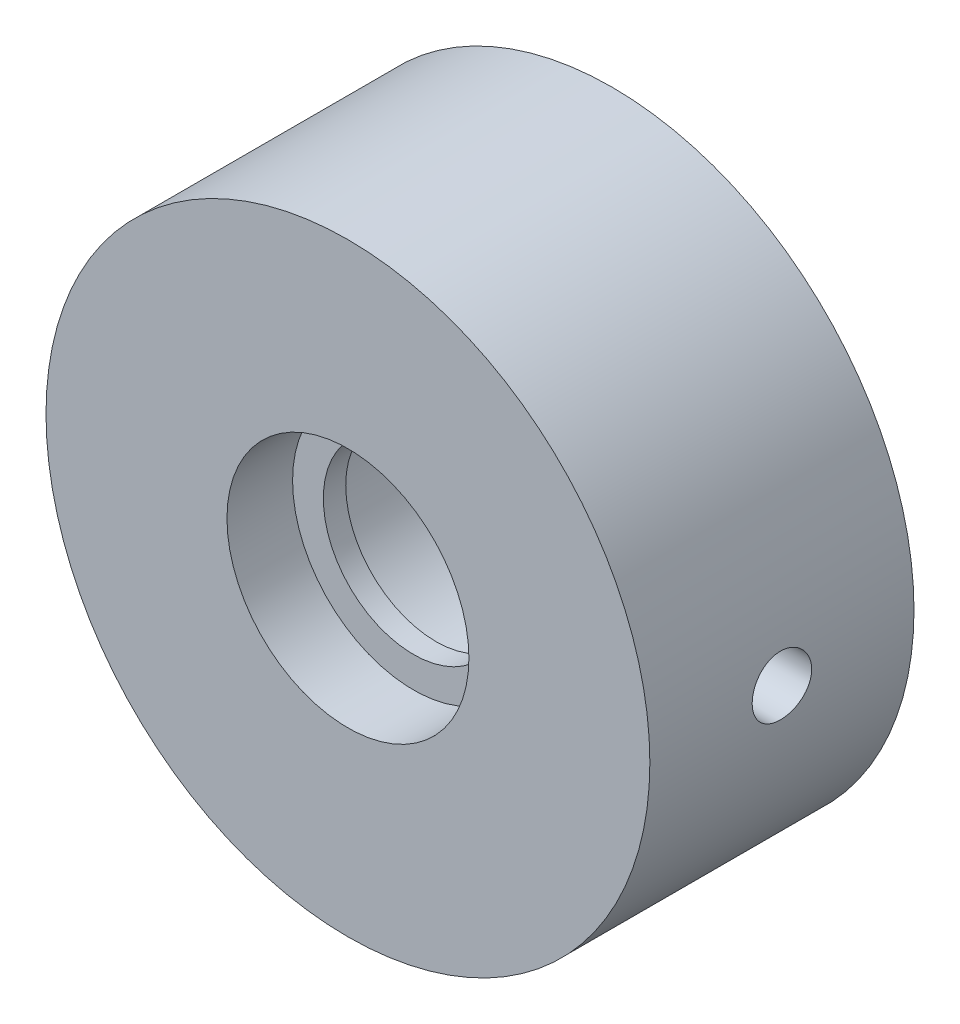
ISO-10303-21;
HEADER;
FILE_DESCRIPTION(('STEP AP214'),'2;1');
FILE_NAME('part.step','',(''),(''),'','','');
FILE_SCHEMA(('AUTOMOTIVE_DESIGN { 1 0 10303 214 1 1 1 1 }'));
ENDSEC;
DATA;
#1=APPLICATION_CONTEXT('core data for automotive mechanical design processes');
#2=APPLICATION_PROTOCOL_DEFINITION('international standard','automotive_design',2000,#1);
#3=PRODUCT_CONTEXT('',#1,'mechanical');
#4=PRODUCT('Part','Part','',(#3));
#5=PRODUCT_RELATED_PRODUCT_CATEGORY('part','',(#4));
#6=PRODUCT_DEFINITION_FORMATION('','',#4);
#7=PRODUCT_DEFINITION_CONTEXT('part definition',#1,'design');
#8=PRODUCT_DEFINITION('design','',#6,#7);
#9=PRODUCT_DEFINITION_SHAPE('','',#8);
#10=(LENGTH_UNIT() NAMED_UNIT(*) SI_UNIT(.MILLI.,.METRE.));
#11=(NAMED_UNIT(*) PLANE_ANGLE_UNIT() SI_UNIT($,.RADIAN.));
#12=(NAMED_UNIT(*) SI_UNIT($,.STERADIAN.) SOLID_ANGLE_UNIT());
#13=UNCERTAINTY_MEASURE_WITH_UNIT(LENGTH_MEASURE(1.E-05),#10,'distance_accuracy_value','');
#14=(GEOMETRIC_REPRESENTATION_CONTEXT(3) GLOBAL_UNCERTAINTY_ASSIGNED_CONTEXT((#13)) GLOBAL_UNIT_ASSIGNED_CONTEXT((#10,
#11,#12)) REPRESENTATION_CONTEXT('',''));
#15=CARTESIAN_POINT('',(0.,0.,0.));
#16=DIRECTION('',(0.,0.,1.));
#17=DIRECTION('',(1.,0.,0.));
#18=AXIS2_PLACEMENT_3D('',#15,#16,#17);
#19=CARTESIAN_POINT('',(0.,0.,12.7));
#20=DIRECTION('',(0.,0.,-1.));
#21=DIRECTION('',(-1.,0.,0.));
#22=AXIS2_PLACEMENT_3D('',#19,#20,#21);
#23=CYLINDRICAL_SURFACE('',#22,29.95);
#24=CARTESIAN_POINT('',(-29.95,0.,2.55));
#25=CARTESIAN_POINT('',(-29.9499981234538,-0.165273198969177,2.54999283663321));
#26=CARTESIAN_POINT('',(-29.9486174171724,-0.330655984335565,2.53606414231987));
#27=CARTESIAN_POINT('',(-29.9432422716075,-0.656837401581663,2.48070961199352));
#28=CARTESIAN_POINT('',(-29.9392449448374,-0.817630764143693,2.43925339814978));
#29=CARTESIAN_POINT('',(-29.9290878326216,-1.12986261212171,2.33006160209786));
#30=CARTESIAN_POINT('',(-29.922929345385,-1.28130664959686,2.26234179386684));
#31=CARTESIAN_POINT('',(-29.9091387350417,-1.57064517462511,2.10257551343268));
#32=CARTESIAN_POINT('',(-29.9015069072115,-1.70854236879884,2.01053391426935));
#33=CARTESIAN_POINT('',(-29.8855948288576,-1.96738830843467,1.80439121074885));
#34=CARTESIAN_POINT('',(-29.8773126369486,-2.08828305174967,1.69022244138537));
#35=CARTESIAN_POINT('',(-29.8610493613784,-2.30922826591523,1.44321043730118));
#36=CARTESIAN_POINT('',(-29.8530682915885,-2.40927777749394,1.310366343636));
#37=CARTESIAN_POINT('',(-29.8382909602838,-2.58588296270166,1.02943767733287));
#38=CARTESIAN_POINT('',(-29.831497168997,-2.66238989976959,0.881322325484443));
#39=CARTESIAN_POINT('',(-29.8198874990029,-2.78942697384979,0.574269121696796));
#40=CARTESIAN_POINT('',(-29.815071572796,-2.83995773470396,0.415331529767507));
#41=CARTESIAN_POINT('',(-29.807980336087,-2.91344829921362,0.0916953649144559));
#42=CARTESIAN_POINT('',(-29.8056967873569,-2.9364975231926,-0.0729827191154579));
#43=CARTESIAN_POINT('',(-29.803903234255,-2.95464712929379,-0.403884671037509));
#44=CARTESIAN_POINT('',(-29.8043931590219,-2.94974822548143,-0.570108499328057));
#45=CARTESIAN_POINT('',(-29.8080836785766,-2.91221436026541,-0.898767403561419));
#46=CARTESIAN_POINT('',(-29.8112747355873,-2.87967698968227,-1.06121374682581));
#47=CARTESIAN_POINT('',(-29.8199930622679,-2.78794163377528,-1.37832860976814));
#48=CARTESIAN_POINT('',(-29.8255203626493,-2.72874329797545,-1.53299702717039));
#49=CARTESIAN_POINT('',(-29.8382993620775,-2.58525856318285,-1.83047411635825));
#50=CARTESIAN_POINT('',(-29.845554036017,-2.50092881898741,-1.97326174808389));
#51=CARTESIAN_POINT('',(-29.8609678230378,-2.30960623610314,-2.24269382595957));
#52=CARTESIAN_POINT('',(-29.8691269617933,-2.20261275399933,-2.36933781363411));
#53=CARTESIAN_POINT('',(-29.8854728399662,-1.96845455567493,-2.60345477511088));
#54=CARTESIAN_POINT('',(-29.8936595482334,-1.84120554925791,-2.71084346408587));
#55=CARTESIAN_POINT('',(-29.9091051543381,-1.57044125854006,-2.90274834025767));
#56=CARTESIAN_POINT('',(-29.916364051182,-1.42692595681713,-2.98726450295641));
#57=CARTESIAN_POINT('',(-29.9291384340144,-1.12764490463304,-3.13102166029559));
#58=CARTESIAN_POINT('',(-29.934653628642,-0.971877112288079,-3.19025843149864));
#59=CARTESIAN_POINT('',(-29.9433161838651,-0.652540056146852,-3.28171378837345));
#60=CARTESIAN_POINT('',(-29.9464636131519,-0.488971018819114,-3.31393315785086));
#61=CARTESIAN_POINT('',(-29.9500271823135,-0.159404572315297,-3.35033231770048));
#62=CARTESIAN_POINT('',(-29.9504546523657,0.0065798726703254,-3.35462842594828));
#63=CARTESIAN_POINT('',(-29.9485605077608,0.336906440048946,-3.33536454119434));
#64=CARTESIAN_POINT('',(-29.9462389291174,0.501248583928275,-3.31180491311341));
#65=CARTESIAN_POINT('',(-29.9391148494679,0.823290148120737,-3.23759481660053));
#66=CARTESIAN_POINT('',(-29.934317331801,0.981002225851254,-3.18699875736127));
#67=CARTESIAN_POINT('',(-29.9227796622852,1.28570010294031,-3.06020791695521));
#68=CARTESIAN_POINT('',(-29.916039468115,1.43268566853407,-2.98401257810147));
#69=CARTESIAN_POINT('',(-29.9013423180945,1.71228438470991,-2.80789724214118));
#70=CARTESIAN_POINT('',(-29.8933814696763,1.84484915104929,-2.70790076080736));
#71=CARTESIAN_POINT('',(-29.877148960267,2.09135360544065,-2.48713141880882));
#72=CARTESIAN_POINT('',(-29.868877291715,2.20529284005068,-2.36635805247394));
#73=CARTESIAN_POINT('',(-29.8529213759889,2.41171530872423,-2.10695599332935));
#74=CARTESIAN_POINT('',(-29.8452392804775,2.50412224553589,-1.96826643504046));
#75=CARTESIAN_POINT('',(-29.8313647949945,2.66433265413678,-1.67726935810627));
#76=CARTESIAN_POINT('',(-29.8251723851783,2.73213645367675,-1.52496202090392));
#77=CARTESIAN_POINT('',(-29.8149916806,2.84108794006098,-1.21131531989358));
#78=CARTESIAN_POINT('',(-29.810999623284,2.88228115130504,-1.04999189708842));
#79=CARTESIAN_POINT('',(-29.8056598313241,2.93698989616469,-0.72267684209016));
#80=CARTESIAN_POINT('',(-29.804312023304,2.95050619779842,-0.556685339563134));
#81=CARTESIAN_POINT('',(-29.8044148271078,2.9494669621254,-0.225504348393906));
#82=CARTESIAN_POINT('',(-29.805853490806,2.93503128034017,-0.0603144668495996));
#83=CARTESIAN_POINT('',(-29.8113416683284,2.87874902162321,0.265281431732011));
#84=CARTESIAN_POINT('',(-29.8153911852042,2.83690241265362,0.425687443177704));
#85=CARTESIAN_POINT('',(-29.8256414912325,2.72701898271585,0.73716219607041));
#86=CARTESIAN_POINT('',(-29.8318420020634,2.65898554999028,0.888232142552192));
#87=CARTESIAN_POINT('',(-29.8456962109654,2.49867214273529,1.17682756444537));
#88=CARTESIAN_POINT('',(-29.8533498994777,2.40639232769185,1.31435312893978));
#89=CARTESIAN_POINT('',(-29.8692873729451,2.19975542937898,1.57257015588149));
#90=CARTESIAN_POINT('',(-29.8775736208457,2.08530907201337,1.69319002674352));
#91=CARTESIAN_POINT('',(-29.8938200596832,1.83776338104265,1.913566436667));
#92=CARTESIAN_POINT('',(-29.901780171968,1.70465958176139,2.01331796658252));
#93=CARTESIAN_POINT('',(-29.9164976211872,1.42322179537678,2.18931716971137));
#94=CARTESIAN_POINT('',(-29.9232519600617,1.27485125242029,2.26550659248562));
#95=CARTESIAN_POINT('',(-29.9347640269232,0.967451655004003,2.39178923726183));
#96=CARTESIAN_POINT('',(-29.939524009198,0.808434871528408,2.44191193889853));
#97=CARTESIAN_POINT('',(-29.9453124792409,0.540428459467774,2.50211409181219));
#98=CARTESIAN_POINT('',(-29.9470621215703,0.433153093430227,2.52004683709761));
#99=CARTESIAN_POINT('',(-29.949406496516,0.217267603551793,2.54399212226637));
#100=CARTESIAN_POINT('',(-29.9500012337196,0.108657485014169,2.55000470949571));
#101=CARTESIAN_POINT('',(-29.95,0.,2.55));
#102=B_SPLINE_CURVE_WITH_KNOTS('',3,(#24,#25,#26,#27,#28,#29,#30,#31,#32,#33,#34,#35,#36,#37,
#38,#39,#40,#41,#42,#43,#44,#45,#46,#47,#48,#49,#50,#51,#52,#53,#54,#55,#56,#57,#58,#59,#60,#61,
#62,#63,#64,#65,#66,#67,#68,#69,#70,#71,#72,#73,#74,#75,#76,#77,#78,#79,#80,#81,#82,#83,#84,#85,
#86,#87,#88,#89,#90,#91,#92,#93,#94,#95,#96,#97,#98,#99,#100,#101),.UNSPECIFIED.,.T.,.F.,(4,2,2,
2,2,2,2,2,2,2,2,2,2,2,2,2,2,2,2,2,2,2,2,2,2,2,2,2,2,2,2,2,2,2,2,2,2,2,4),(0.,0.495422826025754,
0.991393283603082,1.48706632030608,1.98264012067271,2.4797540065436,2.97689076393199,
3.47504984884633,3.97319696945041,4.4697187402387,4.9662278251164,5.46099100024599,
5.95576067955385,6.45138869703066,6.94703078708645,7.44479209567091,7.94255393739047,
8.44039890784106,8.93822943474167,9.43398484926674,9.929733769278,10.4244887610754,
10.9192545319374,11.4156322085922,11.9120219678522,12.4101447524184,12.9082609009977,
13.4055226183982,13.9027705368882,14.3978910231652,14.8930120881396,15.3880691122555,
15.8831228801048,16.380213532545,16.877423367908,17.375852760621,17.8737172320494,
18.199430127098,18.5251417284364),.UNSPECIFIED.);
#103=CARTESIAN_POINT('',(-29.95,0.,2.55));
#104=VERTEX_POINT('',#103);
#105=EDGE_CURVE('E43',#104,#104,#102,.T.);
#106=ORIENTED_EDGE('',*,*,#105,.T.);
#107=EDGE_LOOP('',(#106));
#108=FACE_BOUND('',#107,.T.);
#109=CARTESIAN_POINT('',(0.,0.,12.7));
#110=DIRECTION('',(0.,0.,1.));
#111=DIRECTION('',(1.,0.,0.));
#112=AXIS2_PLACEMENT_3D('',#109,#110,#111);
#113=CIRCLE('',#112,29.95);
#114=CARTESIAN_POINT('',(29.95,0.,12.7));
#115=VERTEX_POINT('',#114);
#116=EDGE_CURVE('E51',#115,#115,#113,.T.);
#117=ORIENTED_EDGE('',*,*,#116,.F.);
#118=EDGE_LOOP('',(#117));
#119=FACE_BOUND('',#118,.T.);
#120=CARTESIAN_POINT('',(0.,0.,-13.5));
#121=DIRECTION('',(0.,0.,-1.));
#122=DIRECTION('',(-1.,0.,0.));
#123=AXIS2_PLACEMENT_3D('',#120,#121,#122);
#124=CIRCLE('',#123,29.95);
#125=CARTESIAN_POINT('',(-29.95,0.,-13.5));
#126=VERTEX_POINT('',#125);
#127=EDGE_CURVE('E104',#126,#126,#124,.T.);
#128=ORIENTED_EDGE('',*,*,#127,.F.);
#129=EDGE_LOOP('',(#128));
#130=FACE_BOUND('',#129,.T.);
#131=CARTESIAN_POINT('',(29.95,0.,-3.35));
#132=CARTESIAN_POINT('',(29.9499981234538,0.165273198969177,-3.3499928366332));
#133=CARTESIAN_POINT('',(29.9486174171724,0.330655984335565,-3.33606414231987));
#134=CARTESIAN_POINT('',(29.9432422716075,0.656837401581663,-3.28070961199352));
#135=CARTESIAN_POINT('',(29.9392449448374,0.817630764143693,-3.23925339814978));
#136=CARTESIAN_POINT('',(29.9290878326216,1.12986261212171,-3.13006160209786));
#137=CARTESIAN_POINT('',(29.922929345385,1.28130664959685,-3.06234179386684));
#138=CARTESIAN_POINT('',(29.9091387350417,1.57064517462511,-2.90257551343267));
#139=CARTESIAN_POINT('',(29.9015069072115,1.70854236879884,-2.81053391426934));
#140=CARTESIAN_POINT('',(29.8855948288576,1.96738830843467,-2.60439121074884));
#141=CARTESIAN_POINT('',(29.8773126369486,2.08828305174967,-2.49022244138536));
#142=CARTESIAN_POINT('',(29.8610493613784,2.30922826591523,-2.24321043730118));
#143=CARTESIAN_POINT('',(29.8530682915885,2.40927777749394,-2.110366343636));
#144=CARTESIAN_POINT('',(29.8382909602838,2.58588296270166,-1.82943767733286));
#145=CARTESIAN_POINT('',(29.831497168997,2.66238989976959,-1.68132232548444));
#146=CARTESIAN_POINT('',(29.8198874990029,2.78942697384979,-1.37426912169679));
#147=CARTESIAN_POINT('',(29.815071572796,2.83995773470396,-1.2153315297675));
#148=CARTESIAN_POINT('',(29.807980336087,2.91344829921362,-0.89169536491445));
#149=CARTESIAN_POINT('',(29.8056967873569,2.9364975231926,-0.727017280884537));
#150=CARTESIAN_POINT('',(29.803903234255,2.95464712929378,-0.396115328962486));
#151=CARTESIAN_POINT('',(29.8043931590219,2.94974822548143,-0.229891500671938));
#152=CARTESIAN_POINT('',(29.8080836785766,2.91221436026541,0.098767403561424));
#153=CARTESIAN_POINT('',(29.8112747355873,2.87967698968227,0.261213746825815));
#154=CARTESIAN_POINT('',(29.8199930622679,2.78794163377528,0.578328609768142));
#155=CARTESIAN_POINT('',(29.8255203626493,2.72874329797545,0.732997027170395));
#156=CARTESIAN_POINT('',(29.8382993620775,2.58525856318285,1.03047411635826));
#157=CARTESIAN_POINT('',(29.845554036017,2.5009288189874,1.1732617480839));
#158=CARTESIAN_POINT('',(29.8609678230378,2.30960623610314,1.44269382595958));
#159=CARTESIAN_POINT('',(29.8691269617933,2.20261275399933,1.56933781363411));
#160=CARTESIAN_POINT('',(29.8854728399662,1.96845455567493,1.80345477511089));
#161=CARTESIAN_POINT('',(29.8936595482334,1.84120554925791,1.91084346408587));
#162=CARTESIAN_POINT('',(29.9091051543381,1.57044125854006,2.10274834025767));
#163=CARTESIAN_POINT('',(29.916364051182,1.42692595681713,2.18726450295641));
#164=CARTESIAN_POINT('',(29.9291384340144,1.12764490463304,2.3310216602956));
#165=CARTESIAN_POINT('',(29.934653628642,0.971877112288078,2.39025843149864));
#166=CARTESIAN_POINT('',(29.9433161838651,0.652540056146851,2.48171378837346));
#167=CARTESIAN_POINT('',(29.9464636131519,0.488971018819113,2.51393315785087));
#168=CARTESIAN_POINT('',(29.9500271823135,0.159404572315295,2.55033231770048));
#169=CARTESIAN_POINT('',(29.9504546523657,-0.00657987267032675,2.55462842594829));
#170=CARTESIAN_POINT('',(29.9485605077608,-0.336906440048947,2.53536454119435));
#171=CARTESIAN_POINT('',(29.9462389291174,-0.501248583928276,2.51180491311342));
#172=CARTESIAN_POINT('',(29.9391148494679,-0.823290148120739,2.43759481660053));
#173=CARTESIAN_POINT('',(29.934317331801,-0.981002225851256,2.38699875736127));
#174=CARTESIAN_POINT('',(29.9227796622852,-1.28570010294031,2.26020791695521));
#175=CARTESIAN_POINT('',(29.916039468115,-1.43268566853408,2.18401257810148));
#176=CARTESIAN_POINT('',(29.9013423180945,-1.71228438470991,2.00789724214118));
#177=CARTESIAN_POINT('',(29.8933814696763,-1.84484915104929,1.90790076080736));
#178=CARTESIAN_POINT('',(29.877148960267,-2.09135360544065,1.68713141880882));
#179=CARTESIAN_POINT('',(29.868877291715,-2.20529284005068,1.56635805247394));
#180=CARTESIAN_POINT('',(29.8529213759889,-2.41171530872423,1.30695599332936));
#181=CARTESIAN_POINT('',(29.8452392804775,-2.50412224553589,1.16826643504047));
#182=CARTESIAN_POINT('',(29.8313647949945,-2.66433265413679,0.877269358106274));
#183=CARTESIAN_POINT('',(29.8251723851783,-2.73213645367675,0.724962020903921));
#184=CARTESIAN_POINT('',(29.8149916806,-2.84108794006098,0.411315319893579));
#185=CARTESIAN_POINT('',(29.810999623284,-2.88228115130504,0.249991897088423));
#186=CARTESIAN_POINT('',(29.8056598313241,-2.93698989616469,-0.0773231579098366));
#187=CARTESIAN_POINT('',(29.804312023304,-2.95050619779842,-0.243314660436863));
#188=CARTESIAN_POINT('',(29.8044148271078,-2.9494669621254,-0.57449565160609));
#189=CARTESIAN_POINT('',(29.805853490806,-2.93503128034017,-0.739685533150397));
#190=CARTESIAN_POINT('',(29.8113416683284,-2.87874902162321,-1.06528143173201));
#191=CARTESIAN_POINT('',(29.8153911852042,-2.83690241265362,-1.2256874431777));
#192=CARTESIAN_POINT('',(29.8256414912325,-2.72701898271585,-1.53716219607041));
#193=CARTESIAN_POINT('',(29.8318420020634,-2.65898554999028,-1.68823214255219));
#194=CARTESIAN_POINT('',(29.8456962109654,-2.49867214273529,-1.97682756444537));
#195=CARTESIAN_POINT('',(29.8533498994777,-2.40639232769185,-2.11435312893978));
#196=CARTESIAN_POINT('',(29.8692873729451,-2.19975542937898,-2.37257015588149));
#197=CARTESIAN_POINT('',(29.8775736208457,-2.08530907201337,-2.49319002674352));
#198=CARTESIAN_POINT('',(29.8938200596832,-1.83776338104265,-2.713566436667));
#199=CARTESIAN_POINT('',(29.901780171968,-1.70465958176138,-2.81331796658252));
#200=CARTESIAN_POINT('',(29.9164976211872,-1.42322179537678,-2.98931716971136));
#201=CARTESIAN_POINT('',(29.9232519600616,-1.27485125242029,-3.06550659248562));
#202=CARTESIAN_POINT('',(29.9347640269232,-0.967451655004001,-3.19178923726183));
#203=CARTESIAN_POINT('',(29.939524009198,-0.808434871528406,-3.24191193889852));
#204=CARTESIAN_POINT('',(29.9453124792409,-0.540428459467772,-3.30211409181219));
#205=CARTESIAN_POINT('',(29.9470621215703,-0.433153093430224,-3.32004683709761));
#206=CARTESIAN_POINT('',(29.949406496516,-0.217267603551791,-3.34399212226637));
#207=CARTESIAN_POINT('',(29.9500012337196,-0.108657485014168,-3.3500047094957));
#208=CARTESIAN_POINT('',(29.95,0.,-3.35));
#209=B_SPLINE_CURVE_WITH_KNOTS('',3,(#131,#132,#133,#134,#135,#136,#137,#138,#139,#140,#141,
#142,#143,#144,#145,#146,#147,#148,#149,#150,#151,#152,#153,#154,#155,#156,#157,#158,#159,#160,
#161,#162,#163,#164,#165,#166,#167,#168,#169,#170,#171,#172,#173,#174,#175,#176,#177,#178,#179,
#180,#181,#182,#183,#184,#185,#186,#187,#188,#189,#190,#191,#192,#193,#194,#195,#196,#197,#198,
#199,#200,#201,#202,#203,#204,#205,#206,#207,#208),.UNSPECIFIED.,.T.,.F.,(4,2,2,2,2,2,2,2,2,2,2,
2,2,2,2,2,2,2,2,2,2,2,2,2,2,2,2,2,2,2,2,2,2,2,2,2,2,2,4),(0.,0.495422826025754,
0.991393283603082,1.48706632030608,1.98264012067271,2.4797540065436,2.97689076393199,
3.47504984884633,3.97319696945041,4.4697187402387,4.9662278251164,5.46099100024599,
5.95576067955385,6.45138869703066,6.94703078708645,7.4447920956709,7.94255393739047,
8.44039890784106,8.93822943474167,9.43398484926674,9.929733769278,10.4244887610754,
10.9192545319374,11.4156322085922,11.9120219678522,12.4101447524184,12.9082609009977,
13.4055226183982,13.9027705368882,14.3978910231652,14.8930120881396,15.3880691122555,
15.8831228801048,16.380213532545,16.877423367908,17.375852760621,17.8737172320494,
18.199430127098,18.5251417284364),.UNSPECIFIED.);
#210=CARTESIAN_POINT('',(29.95,0.,-3.35));
#211=VERTEX_POINT('',#210);
#212=EDGE_CURVE('E10',#211,#211,#209,.T.);
#213=ORIENTED_EDGE('',*,*,#212,.F.);
#214=EDGE_LOOP('',(#213));
#215=FACE_BOUND('',#214,.T.);
#216=ADVANCED_FACE('F33',(#108,#119,#130,#215),#23,.T.);
#217=CARTESIAN_POINT('',(0.,0.,12.7));
#218=DIRECTION('',(0.,0.,-1.));
#219=DIRECTION('',(-1.,0.,0.));
#220=AXIS2_PLACEMENT_3D('',#217,#218,#219);
#221=CYLINDRICAL_SURFACE('',#220,12.);
#222=CARTESIAN_POINT('',(0.,0.,12.7));
#223=DIRECTION('',(0.,0.,-1.));
#224=DIRECTION('',(-1.,0.,0.));
#225=AXIS2_PLACEMENT_3D('',#222,#223,#224);
#226=CIRCLE('',#225,12.);
#227=CARTESIAN_POINT('',(-12.,0.,12.7));
#228=VERTEX_POINT('',#227);
#229=EDGE_CURVE('E118',#228,#228,#226,.T.);
#230=ORIENTED_EDGE('',*,*,#229,.F.);
#231=EDGE_LOOP('',(#230));
#232=FACE_BOUND('',#231,.T.);
#233=CARTESIAN_POINT('',(0.,0.,6.19125));
#234=DIRECTION('',(0.,0.,-1.));
#235=DIRECTION('',(-1.,0.,0.));
#236=AXIS2_PLACEMENT_3D('',#233,#234,#235);
#237=CIRCLE('',#236,12.);
#238=CARTESIAN_POINT('',(-12.,0.,6.19125));
#239=VERTEX_POINT('',#238);
#240=EDGE_CURVE('E47',#239,#239,#237,.F.);
#241=ORIENTED_EDGE('',*,*,#240,.F.);
#242=EDGE_LOOP('',(#241));
#243=FACE_BOUND('',#242,.T.);
#244=ADVANCED_FACE('F85',(#232,#243),#221,.F.);
#245=CARTESIAN_POINT('',(0.,0.,12.7));
#246=DIRECTION('',(0.,0.,1.));
#247=DIRECTION('',(1.,0.,0.));
#248=AXIS2_PLACEMENT_3D('',#245,#246,#247);
#249=PLANE('',#248);
#250=ORIENTED_EDGE('',*,*,#229,.T.);
#251=EDGE_LOOP('',(#250));
#252=FACE_BOUND('',#251,.T.);
#253=ORIENTED_EDGE('',*,*,#116,.T.);
#254=EDGE_LOOP('',(#253));
#255=FACE_BOUND('',#254,.T.);
#256=ADVANCED_FACE('F83',(#252,#255),#249,.T.);
#257=CARTESIAN_POINT('',(0.,0.,3.96875));
#258=DIRECTION('',(0.,0.,-1.));
#259=DIRECTION('',(-1.,0.,0.));
#260=AXIS2_PLACEMENT_3D('',#257,#258,#259);
#261=CIRCLE('',#260,12.);
#262=CARTESIAN_POINT('',(-12.,0.,3.96875));
#263=VERTEX_POINT('',#262);
#264=EDGE_CURVE('E115',#263,#263,#261,.T.);
#265=ORIENTED_EDGE('',*,*,#264,.F.);
#266=EDGE_LOOP('',(#265));
#267=FACE_BOUND('',#266,.T.);
#268=CARTESIAN_POINT('',(0.,0.,-13.5));
#269=DIRECTION('',(0.,0.,-1.));
#270=DIRECTION('',(-1.,0.,0.));
#271=AXIS2_PLACEMENT_3D('',#268,#269,#270);
#272=CIRCLE('',#271,12.);
#273=CARTESIAN_POINT('',(-12.,0.,-13.5));
#274=VERTEX_POINT('',#273);
#275=EDGE_CURVE('E106',#274,#274,#272,.T.);
#276=ORIENTED_EDGE('',*,*,#275,.T.);
#277=EDGE_LOOP('',(#276));
#278=FACE_BOUND('',#277,.T.);
#279=ADVANCED_FACE('F80',(#267,#278),#221,.F.);
#280=CARTESIAN_POINT('',(0.,0.,3.96875));
#281=DIRECTION('',(0.,0.,-1.));
#282=DIRECTION('',(-1.,0.,0.));
#283=AXIS2_PLACEMENT_3D('',#280,#281,#282);
#284=PLANE('',#283);
#285=CARTESIAN_POINT('',(0.,0.,3.96875));
#286=DIRECTION('',(0.,0.,-1.));
#287=DIRECTION('',(-1.,0.,0.));
#288=AXIS2_PLACEMENT_3D('',#285,#286,#287);
#289=CIRCLE('',#288,8.95);
#290=CARTESIAN_POINT('',(-8.95,0.,3.96875));
#291=VERTEX_POINT('',#290);
#292=EDGE_CURVE('E57',#291,#291,#289,.T.);
#293=ORIENTED_EDGE('',*,*,#292,.F.);
#294=EDGE_LOOP('',(#293));
#295=FACE_BOUND('',#294,.T.);
#296=ORIENTED_EDGE('',*,*,#264,.T.);
#297=EDGE_LOOP('',(#296));
#298=FACE_BOUND('',#297,.T.);
#299=ADVANCED_FACE('F76',(#295,#298),#284,.T.);
#300=CARTESIAN_POINT('',(0.,0.,6.19125));
#301=DIRECTION('',(0.,0.,-1.));
#302=DIRECTION('',(-1.,0.,0.));
#303=AXIS2_PLACEMENT_3D('',#300,#301,#302);
#304=PLANE('',#303);
#305=CARTESIAN_POINT('',(0.,0.,6.19125));
#306=DIRECTION('',(0.,0.,1.));
#307=DIRECTION('',(1.,0.,0.));
#308=AXIS2_PLACEMENT_3D('',#305,#306,#307);
#309=CIRCLE('',#308,8.95);
#310=CARTESIAN_POINT('',(8.95,0.,6.19125));
#311=VERTEX_POINT('',#310);
#312=EDGE_CURVE('E105',#311,#311,#309,.T.);
#313=ORIENTED_EDGE('',*,*,#312,.F.);
#314=EDGE_LOOP('',(#313));
#315=FACE_BOUND('',#314,.T.);
#316=ORIENTED_EDGE('',*,*,#240,.T.);
#317=EDGE_LOOP('',(#316));
#318=FACE_BOUND('',#317,.T.);
#319=ADVANCED_FACE('F72',(#315,#318),#304,.F.);
#320=CARTESIAN_POINT('',(0.,0.,0.));
#321=DIRECTION('',(0.,0.,1.));
#322=DIRECTION('',(1.,0.,0.));
#323=AXIS2_PLACEMENT_3D('',#320,#321,#322);
#324=CYLINDRICAL_SURFACE('',#323,8.95);
#325=ORIENTED_EDGE('',*,*,#292,.T.);
#326=EDGE_LOOP('',(#325));
#327=FACE_BOUND('',#326,.T.);
#328=ORIENTED_EDGE('',*,*,#312,.T.);
#329=EDGE_LOOP('',(#328));
#330=FACE_BOUND('',#329,.T.);
#331=ADVANCED_FACE('F68',(#327,#330),#324,.F.);
#332=CARTESIAN_POINT('',(0.,0.,-13.5));
#333=DIRECTION('',(0.,0.,-1.));
#334=DIRECTION('',(-1.,0.,0.));
#335=AXIS2_PLACEMENT_3D('',#332,#333,#334);
#336=PLANE('',#335);
#337=ORIENTED_EDGE('',*,*,#127,.T.);
#338=EDGE_LOOP('',(#337));
#339=FACE_BOUND('',#338,.T.);
#340=ORIENTED_EDGE('',*,*,#275,.F.);
#341=EDGE_LOOP('',(#340));
#342=FACE_BOUND('',#341,.T.);
#343=ADVANCED_FACE('F64',(#339,#342),#336,.T.);
#344=CARTESIAN_POINT('',(-20.95,0.,-0.399999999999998));
#345=DIRECTION('',(-1.,0.,0.));
#346=DIRECTION('',(0.,0.,1.));
#347=AXIS2_PLACEMENT_3D('',#344,#345,#346);
#348=CYLINDRICAL_SURFACE('',#347,2.95);
#349=CARTESIAN_POINT('',(-20.95,0.,-0.399999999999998));
#350=DIRECTION('',(-1.,0.,0.));
#351=DIRECTION('',(0.,0.,1.));
#352=AXIS2_PLACEMENT_3D('',#349,#350,#351);
#353=CIRCLE('',#352,2.95);
#354=CARTESIAN_POINT('',(-20.95,0.,2.55));
#355=VERTEX_POINT('',#354);
#356=EDGE_CURVE('E111',#355,#355,#353,.T.);
#357=ORIENTED_EDGE('',*,*,#356,.F.);
#358=EDGE_LOOP('',(#357));
#359=FACE_BOUND('',#358,.T.);
#360=ORIENTED_EDGE('',*,*,#105,.F.);
#361=EDGE_LOOP('',(#360));
#362=FACE_BOUND('',#361,.T.);
#363=ADVANCED_FACE('F58',(#359,#362),#348,.F.);
#364=CARTESIAN_POINT('',(-20.95,0.,-0.399999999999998));
#365=DIRECTION('',(-1.,0.,0.));
#366=DIRECTION('',(0.,0.,1.));
#367=AXIS2_PLACEMENT_3D('',#364,#365,#366);
#368=PLANE('',#367);
#369=ORIENTED_EDGE('',*,*,#356,.T.);
#370=EDGE_LOOP('',(#369));
#371=FACE_BOUND('',#370,.T.);
#372=ADVANCED_FACE('F63',(#371),#368,.T.);
#373=CARTESIAN_POINT('',(20.95,0.,-0.399999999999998));
#374=DIRECTION('',(1.,0.,0.));
#375=DIRECTION('',(0.,0.,-1.));
#376=AXIS2_PLACEMENT_3D('',#373,#374,#375);
#377=CYLINDRICAL_SURFACE('',#376,2.95);
#378=CARTESIAN_POINT('',(20.95,0.,-0.399999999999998));
#379=DIRECTION('',(-1.,0.,0.));
#380=DIRECTION('',(0.,0.,1.));
#381=AXIS2_PLACEMENT_3D('',#378,#379,#380);
#382=CIRCLE('',#381,2.95);
#383=CARTESIAN_POINT('',(20.95,0.,2.55));
#384=VERTEX_POINT('',#383);
#385=EDGE_CURVE('E135',#384,#384,#382,.T.);
#386=ORIENTED_EDGE('',*,*,#385,.T.);
#387=EDGE_LOOP('',(#386));
#388=FACE_BOUND('',#387,.T.);
#389=ORIENTED_EDGE('',*,*,#212,.T.);
#390=EDGE_LOOP('',(#389));
#391=FACE_BOUND('',#390,.T.);
#392=ADVANCED_FACE('F139',(#388,#391),#377,.F.);
#393=CARTESIAN_POINT('',(20.95,0.,-0.399999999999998));
#394=DIRECTION('',(1.,0.,0.));
#395=DIRECTION('',(0.,0.,1.));
#396=AXIS2_PLACEMENT_3D('',#393,#394,#395);
#397=PLANE('',#396);
#398=ORIENTED_EDGE('',*,*,#385,.F.);
#399=EDGE_LOOP('',(#398));
#400=FACE_BOUND('',#399,.T.);
#401=ADVANCED_FACE('F141',(#400),#397,.T.);
#402=CLOSED_SHELL('',(#216,#244,#256,#279,#299,#319,#331,#343,#363,#372,#392,#401));
#403=MANIFOLD_SOLID_BREP('B2',#402);
#404=ADVANCED_BREP_SHAPE_REPRESENTATION('',(#18,#403),#14);
#405=SHAPE_DEFINITION_REPRESENTATION(#9,#404);
ENDSEC;
END-ISO-10303-21;
